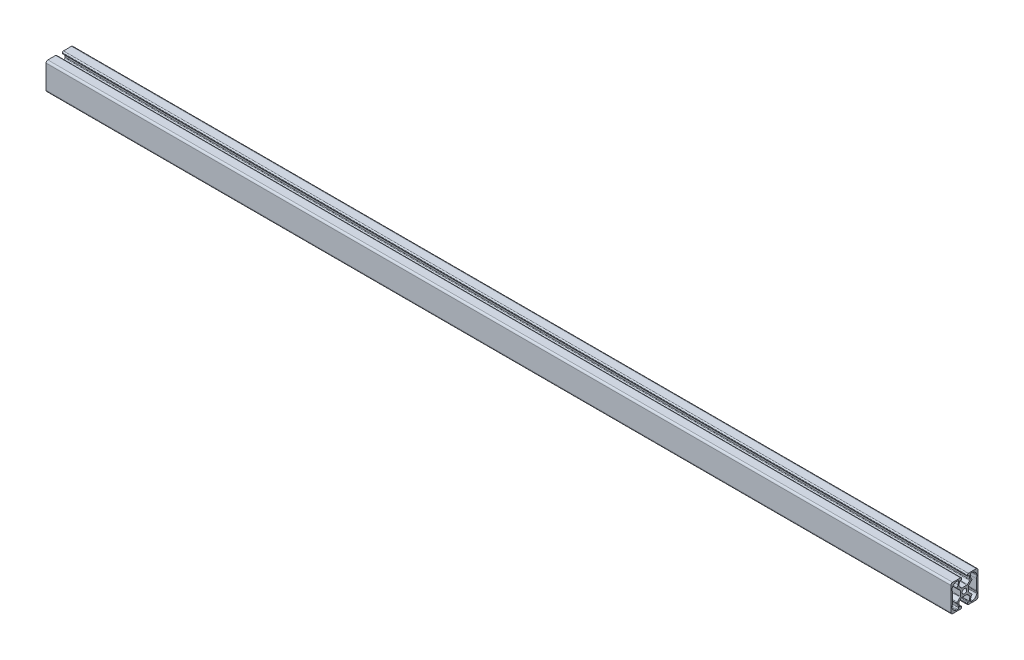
from build123d import *

# Parameters (mm, degrees)
SKETCH_1_R      = 2.55
EXTRUDE_1_DEPTH = 1000


with BuildPart() as part:
    # Sketch 1 → Extrude 1 (new body)
    with BuildSketch(Plane(origin=(0, 0, 0), x_dir=(0, 0, -1), z_dir=(1, 0, 0))):
        with BuildLine():
            Line((2.671572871, 4.499999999), (-2.67157288, 4.499999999))
            ThreePointArc((-2.67157288, 4.499999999), (-3.054256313, 4.576120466), (-3.378679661, 4.792893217))
            Line((-3.378679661, 4.792893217), (-5.794402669, 7.208616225))
            ThreePointArc((-5.794402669, 7.208616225), (-6.041012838, 7.615017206), (-6.072103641, 8.089371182))
            Line((-6.072103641, 8.089371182), (-5.367244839, 12.086824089))
            ThreePointArc((-5.367244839, 12.086824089), (-5.196234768, 12.383022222), (-4.874840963, 12.5))
            Line((-4.874840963, 12.5), (-3.9, 12.5))
            ThreePointArc((-3.9, 12.5), (-3.369669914, 12.719669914), (-3.15, 13.25))
            Line((-3.15, 13.25), (-3.15, 13.8))
            ThreePointArc((-3.15, 13.8), (-3.501471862, 14.648528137), (-4.35, 15))
            Line((-4.35, 15), (-13, 15))
            ThreePointArc((-13, 15), (-14.414213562, 14.414213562), (-15, 13))
            Line((-15, 13), (-15, -13))
            ThreePointArc((-15, -13), (-14.414213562, -14.414213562), (-13, -15))
            Line((-13, -15), (-4.35, -15))
            ThreePointArc((-4.35, -15), (-3.501471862, -14.648528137), (-3.15, -13.8))
            Line((-3.15, -13.8), (-3.15, -13.25))
            ThreePointArc((-3.15, -13.25), (-3.369669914, -12.719669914), (-3.9, -12.5))
            Line((-3.9, -12.5), (-4.874840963, -12.5))
            ThreePointArc((-4.874840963, -12.5), (-5.196234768, -12.383022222), (-5.367244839, -12.086824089))
            Line((-5.367244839, -12.086824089), (-6.07210364, -8.089371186))
            ThreePointArc((-6.07210364, -8.089371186), (-6.041012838, -7.615017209), (-5.794402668, -7.208616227))
            Line((-5.794402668, -7.208616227), (-3.378679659, -4.792893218))
            ThreePointArc((-3.378679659, -4.792893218), (-3.05425631, -4.576120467), (-2.671572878, -4.499999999))
            Line((-2.671572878, -4.499999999), (2.671572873, -4.499999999))
            ThreePointArc((2.671572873, -4.499999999), (3.054256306, -4.576120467), (3.378679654, -4.792893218))
            Line((3.378679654, -4.792893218), (5.794402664, -7.208616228))
            ThreePointArc((5.794402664, -7.208616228), (6.041012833, -7.615017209), (6.072103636, -8.089371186))
            Line((6.072103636, -8.089371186), (5.367244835, -12.086824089))
            ThreePointArc((5.367244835, -12.086824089), (5.196234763, -12.383022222), (4.874840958, -12.5))
            Line((4.874840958, -12.5), (3.899999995, -12.5))
            ThreePointArc((3.899999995, -12.5), (3.369669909, -12.719669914), (3.149999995, -13.25))
            Line((3.149999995, -13.25), (3.149999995, -13.8))
            ThreePointArc((3.149999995, -13.8), (3.501471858, -14.648528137), (4.349999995, -15))
            Line((4.349999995, -15), (12.999999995, -15))
            ThreePointArc((12.999999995, -15), (14.414213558, -14.414213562), (14.999999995, -13))
            Line((14.999999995, -13), (14.999999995, 13))
            ThreePointArc((14.999999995, 13), (14.414213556, 14.414213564), (12.999999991, 15))
            Line((12.999999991, 15), (4.349999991, 15))
            ThreePointArc((4.349999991, 15), (3.501471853, 14.648528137), (3.149999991, 13.8))
            Line((3.149999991, 13.8), (3.149999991, 13.25))
            ThreePointArc((3.149999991, 13.25), (3.369669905, 12.719669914), (3.899999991, 12.5))
            Line((3.899999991, 12.5), (4.874840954, 12.5))
            ThreePointArc((4.874840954, 12.5), (5.196234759, 12.383022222), (5.367244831, 12.086824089))
            Line((5.367244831, 12.086824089), (6.072103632, 8.089371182))
            ThreePointArc((6.072103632, 8.089371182), (6.04101283, 7.615017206), (5.79440266, 7.208616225))
            Line((5.79440266, 7.208616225), (3.378679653, 4.792893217))
            ThreePointArc((3.378679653, 4.792893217), (3.054256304, 4.576120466), (2.671572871, 4.499999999))
        make_face()
        Circle(SKETCH_1_R, mode=Mode.SUBTRACT)
        with BuildLine():
            Line((-13.1, -5.757647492), (-13.1, 5.757647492))
            ThreePointArc((-13.1, 5.757647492), (-13.176461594, 6.30537005), (-13.4, 6.811212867))
            ThreePointArc((-13.4, 6.811212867), (-13.623538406, 7.317055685), (-13.7, 7.864778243))
            Line((-13.7, 7.864778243), (-13.7, 8.90074537))
            ThreePointArc((-13.7, 8.90074537), (-13.693569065, 9.013973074), (-13.674358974, 9.125744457))
            ThreePointArc((-13.674358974, 9.125744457), (-12.052138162, 12.052138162), (-9.125744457, 13.674358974))
            ThreePointArc((-9.125744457, 13.674358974), (-9.013973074, 13.693569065), (-8.90074537, 13.7))
            Line((-8.90074537, 13.7), (-7.493063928, 13.7))
            ThreePointArc((-7.493063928, 13.7), (-6.727019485, 13.34278761), (-6.508256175, 12.526351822))
            Line((-6.508256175, 12.526351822), (-7.045576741, 9.479055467))
            ThreePointArc((-7.045576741, 9.479055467), (-7.338967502, 8.614754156), (-7.878679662, 7.87867965))
            ThreePointArc((-7.878679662, 7.87867965), (-8.17157288, 7.171572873), (-7.878679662, 6.464466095))
            Line((-7.878679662, 6.464466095), (-4.792893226, 3.378679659))
            ThreePointArc((-4.792893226, 3.378679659), (-4.57612047, 3.054256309), (-4.5, 2.671572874))
            Line((-4.5, 2.671572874), (-4.5, -2.671572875))
            ThreePointArc((-4.5, -2.671572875), (-4.576120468, -3.054256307), (-4.792893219, -3.378679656))
            Line((-4.792893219, -3.378679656), (-7.878679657, -6.464466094))
            ThreePointArc((-7.878679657, -6.464466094), (-8.171572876, -7.171572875), (-7.878679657, -7.878679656))
            ThreePointArc((-7.878679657, -7.878679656), (-7.338967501, -8.61475416), (-7.045576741, -9.479055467))
            Line((-7.045576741, -9.479055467), (-6.508256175, -12.526351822))
            ThreePointArc((-6.508256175, -12.526351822), (-6.727019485, -13.34278761), (-7.493063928, -13.7))
            Line((-7.493063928, -13.7), (-8.90074537, -13.7))
            ThreePointArc((-8.90074537, -13.7), (-9.013973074, -13.693569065), (-9.125744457, -13.674358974))
            ThreePointArc((-9.125744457, -13.674358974), (-12.052138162, -12.052138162), (-13.674358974, -9.125744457))
            ThreePointArc((-13.674358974, -9.125744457), (-13.693569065, -9.013973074), (-13.7, -8.90074537))
            Line((-13.7, -8.90074537), (-13.7, -7.864778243))
            ThreePointArc((-13.7, -7.864778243), (-13.623538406, -7.317055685), (-13.4, -6.811212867))
            ThreePointArc((-13.4, -6.811212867), (-13.176461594, -6.30537005), (-13.1, -5.757647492))
        make_face(mode=Mode.SUBTRACT)
        with BuildLine():
            Line((4.79289322, 3.378679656), (7.878679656, 6.464466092))
            ThreePointArc((7.878679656, 6.464466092), (8.171572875, 7.171572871), (7.878679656, 7.878679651))
            ThreePointArc((7.878679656, 7.878679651), (7.338967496, 8.614754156), (7.045576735, 9.479055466))
            Line((7.045576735, 9.479055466), (6.50825617, 12.526351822))
            ThreePointArc((6.50825617, 12.526351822), (6.72701948, 13.342787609), (7.493063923, 13.699999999))
            Line((7.493063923, 13.699999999), (8.900745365, 13.699999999))
            ThreePointArc((8.900745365, 13.699999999), (9.013973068, 13.693569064), (9.125744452, 13.674358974))
            ThreePointArc((9.125744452, 13.674358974), (12.052138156, 12.052138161), (13.674358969, 9.125744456))
            ThreePointArc((13.674358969, 9.125744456), (13.69356906, 9.013973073), (13.699999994, 8.90074537))
            Line((13.699999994, 8.90074537), (13.699999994, 7.864778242))
            ThreePointArc((13.699999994, 7.864778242), (13.623538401, 7.317055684), (13.399999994, 6.811212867))
            ThreePointArc((13.399999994, 6.811212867), (13.176461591, 6.305370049), (13.1, 5.757647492))
            Line((13.1, 5.757647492), (13.1, -5.757647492))
            ThreePointArc((13.1, -5.757647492), (13.176461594, -6.30537005), (13.4, -6.811212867))
            ThreePointArc((13.4, -6.811212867), (13.623538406, -7.317055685), (13.7, -7.864778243))
            Line((13.7, -7.864778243), (13.7, -8.90074537))
            ThreePointArc((13.7, -8.90074537), (13.693569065, -9.013973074), (13.674358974, -9.125744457))
            ThreePointArc((13.674358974, -9.125744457), (12.052138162, -12.052138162), (9.125744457, -13.674358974))
            ThreePointArc((9.125744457, -13.674358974), (9.013973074, -13.693569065), (8.90074537, -13.7))
            Line((8.90074537, -13.7), (7.493063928, -13.7))
            ThreePointArc((7.493063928, -13.7), (6.727019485, -13.34278761), (6.508256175, -12.526351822))
            Line((6.508256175, -12.526351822), (7.045576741, -9.479055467))
            ThreePointArc((7.045576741, -9.479055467), (7.3389675, -8.61475416), (7.878679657, -7.878679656))
            ThreePointArc((7.878679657, -7.878679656), (8.171572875, -7.171572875), (7.878679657, -6.464466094))
            Line((7.878679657, -6.464466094), (4.792893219, -3.378679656))
            ThreePointArc((4.792893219, -3.378679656), (4.576120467, -3.054256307), (4.5, -2.671572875))
            Line((4.5, -2.671572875), (4.5, 2.671572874))
            ThreePointArc((4.5, 2.671572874), (4.576120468, 3.054256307), (4.79289322, 3.378679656))
        make_face(mode=Mode.SUBTRACT)
    extrude(amount=EXTRUDE_1_DEPTH)


solid = part.part
